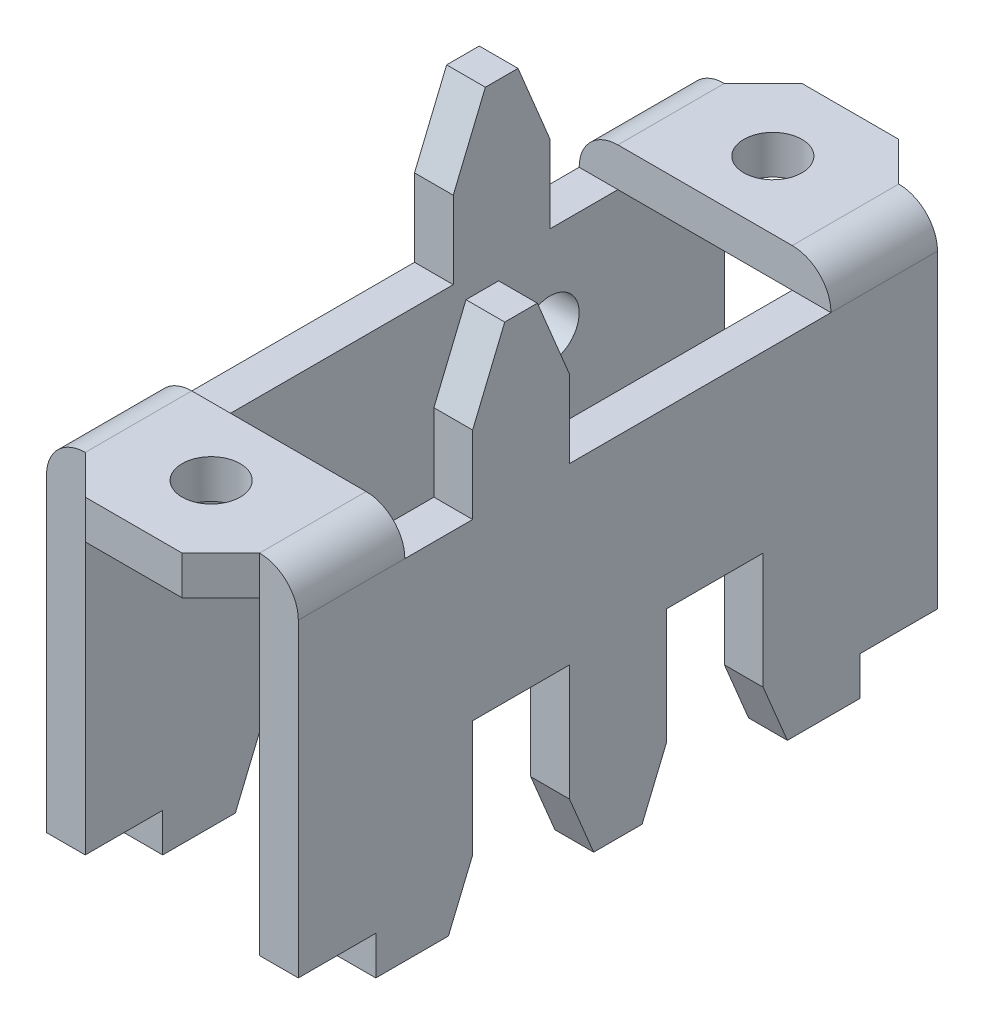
from build123d import *
from OCP.BRepFilletAPI import BRepFilletAPI_MakeChamfer

# Parameters (mm, degrees)
BOSS_EXTRU_1_DEPTH      = 18.5
ESQUISSE2_W             = 13
ESQUISSE2_H             = 22
ENL_V_MAT_EXTRU_1_DEPTH = 2
ESQUISSE3_R             = 1.5
ENL_V_MAT_EXTRU_2_DEPTH = 29.008927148
ESQUISSE4_W             = 4
ESQUISSE4_H             = 2
ENL_V_MAT_EXTRU_3_DEPTH = 31.186917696
ENL_V_MAT_EXTRU_4_REACH = 32.187
ESQUISSE5_R             = 1.5
ESQUISSE6_W             = 2
ESQUISSE6_H             = 5
BOSS_EXTRU_2_DEPTH      = 8
CHANFREIN1_SIZE         = 4
CHANFREIN1_SIZE2        = 1.656854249


with BuildPart() as part:
    # Esquisse1 → Boss.-Extru.1 (new, symmetric)
    with BuildSketch(Plane.XY):
        with BuildLine():
            Line((4.5, -20), (6.5, -20))
            Line((6.5, -20), (6.5, -2))
            ThreePointArc((6.5, -2), (5.914213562, -0.585786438), (4.5, 0))
            Line((4.5, 0), (-4.5, 0))
            ThreePointArc((-4.5, 0), (-5.914213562, -0.585786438), (-6.5, -2))
            Line((-6.5, -2), (-6.5, -20))
            Line((-6.5, -20), (-4.5, -20))
            Line((-4.5, -20), (-4.5, -2))
            Line((-4.5, -2), (4.5, -2))
            Line((4.5, -2), (4.5, -20))
        make_face()
    extrude(amount=BOSS_EXTRU_1_DEPTH, both=True)

    # Esquisse2 → Enl_v. mat.-Extru.1 (cut)
    with BuildSketch(Plane(origin=(0, 0, 0), x_dir=(1, 0, 0), z_dir=(0, 1, 0))):
        Rectangle(ESQUISSE2_W, ESQUISSE2_H)
    extrude(amount=-ENL_V_MAT_EXTRU_1_DEPTH, mode=Mode.SUBTRACT)

    # Esquisse3 → Enl_v. mat.-Extru.2 (cut, through all)
    with BuildSketch(Plane(origin=(0, 0, 0), x_dir=(1, 0, 0), z_dir=(0, 1, 0))):
        with Locations(Location((0, 14.5, 0), (0, 0, 270))):
            Circle(ESQUISSE3_R)
        with Locations(Location((0, -14.5, 0), (0, 0, 270))):
            Circle(ESQUISSE3_R)
        Polygon((-6.5, 16.5), (-4.5, 16.5), (-2.5, 18.5), (2.5, 18.5), (4.5, 16.5), (6.5, 16.5), (6.5, 19.5), (-6.5, 19.5), align=None)
        Polygon((-6.5, -16.5), (-6.5, -19.5), (6.5, -19.5), (6.5, -16.5), (4.5, -16.5), (2.5, -18.5), (-2.5, -18.5), (-4.5, -16.5), align=None)
    extrude(amount=-ENL_V_MAT_EXTRU_2_DEPTH, mode=Mode.SUBTRACT)

    # Esquisse4 → Enl_v. mat.-Extru.3 (cut, through all)
    with BuildSketch(Plane.ZY.offset(6.5)):
        Polygon((1.25, -20), (8.75, -20), (7.5, -17), (7.5, -11), (2.5, -11), (2.5, -17), align=None)
        with Locations((14.5, -19)):
            Rectangle(ESQUISSE4_W, ESQUISSE4_H)
        Polygon((-2.5, -17), (-1.25, -20), (-8.75, -20), (-7.5, -17), (-7.5, -11), (-2.5, -11), align=None)
        with Locations((-14.5, -19)):
            Rectangle(ESQUISSE4_W, ESQUISSE4_H)
    extrude(amount=-ENL_V_MAT_EXTRU_3_DEPTH, mode=Mode.SUBTRACT)

    # Esquisse5 → Enl_v. mat.-Extru.4 (cut, up to next)
    with BuildSketch(Plane.ZY.offset(6.5), mode=Mode.PRIVATE) as enl_v_mat_extru_4_sk1:
        with Locations(Location((-7.5, -6.5, 0), (0, 0, 270))):
            Circle(ESQUISSE5_R)
    enl_v_mat_extru_4_tool1 = extrude(enl_v_mat_extru_4_sk1.sketch, amount=-ENL_V_MAT_EXTRU_4_REACH, mode=Mode.PRIVATE) & part.part
    # Esquisse5 → Enl_v. mat.-Extru.4 (cut, up to next)
    with BuildSketch(Plane.ZY.offset(6.5), mode=Mode.PRIVATE) as enl_v_mat_extru_4_sk2:
        with Locations(Location((7.5, -6.5, 0), (0, 0, 270))):
            Circle(ESQUISSE5_R)
    enl_v_mat_extru_4_tool2 = extrude(enl_v_mat_extru_4_sk2.sketch, amount=-ENL_V_MAT_EXTRU_4_REACH, mode=Mode.PRIVATE) & part.part
    add(enl_v_mat_extru_4_tool1.solids().sort_by_distance((-6.5, -6.5, -7.5))[0], mode=Mode.SUBTRACT)
    add(enl_v_mat_extru_4_tool2.solids().sort_by_distance((-6.5, -6.5, 7.5))[0], mode=Mode.SUBTRACT)

    # Esquisse6 → Boss.-Extru.2 (add)
    with BuildSketch(Plane(origin=(0, -2, 0), x_dir=(1, 0, 0), z_dir=(0, 1, 0))):
        with Locations((-5.5, 5)):
            Rectangle(ESQUISSE6_W, ESQUISSE6_H)
        with Locations((5.5, -5)):
            Rectangle(ESQUISSE6_W, ESQUISSE6_H)
    extrude(amount=BOSS_EXTRU_2_DEPTH)

    # Chanfrein1: one chamfer whose edges measure the first distance from different faces: ONE call of the kernel's chamfer builder (chamfer() names one face for all edges)
    chanfrein1_edges_1 = [part.edges().sort_by_distance(p)[0] for p in [
        (-5.5, 6, -7.5),
    ]]
    chanfrein1_side_1 = [part.faces().sort_by_distance(p)[0] for p in [
        (-5.5, 2, -7.5),
    ]]
    chanfrein1_edges_2 = [part.edges().sort_by_distance(p)[0] for p in [
        (-5.5, 6, -2.5),
    ]]
    chanfrein1_side_2 = [part.faces().sort_by_distance(p)[0] for p in [
        (-5.5, 2, -2.5),
    ]]
    chanfrein1_edges_3 = [part.edges().sort_by_distance(p)[0] for p in [
        (5.5, 6, 2.5),
    ]]
    chanfrein1_side_3 = [part.faces().sort_by_distance(p)[0] for p in [
        (5.5, 2, 2.5),
    ]]
    chanfrein1_edges_4 = [part.edges().sort_by_distance(p)[0] for p in [
        (5.5, 6, 7.5),
    ]]
    chanfrein1_side_4 = [part.faces().sort_by_distance(p)[0] for p in [
        (5.5, 2, 7.5),
    ]]
    chanfrein1 = BRepFilletAPI_MakeChamfer(part.part.solid().wrapped)
    for e in chanfrein1_edges_1:
        chanfrein1.Add(CHANFREIN1_SIZE, CHANFREIN1_SIZE2, e.wrapped, chanfrein1_side_1[0].wrapped)  # the first distance lies on this face
    for e in chanfrein1_edges_2:
        chanfrein1.Add(CHANFREIN1_SIZE, CHANFREIN1_SIZE2, e.wrapped, chanfrein1_side_2[0].wrapped)  # the first distance lies on this face
    for e in chanfrein1_edges_3:
        chanfrein1.Add(CHANFREIN1_SIZE, CHANFREIN1_SIZE2, e.wrapped, chanfrein1_side_3[0].wrapped)  # the first distance lies on this face
    for e in chanfrein1_edges_4:
        chanfrein1.Add(CHANFREIN1_SIZE, CHANFREIN1_SIZE2, e.wrapped, chanfrein1_side_4[0].wrapped)  # the first distance lies on this face
    add(Compound.cast(chanfrein1.Shape()), mode=Mode.REPLACE)


solid = part.part
